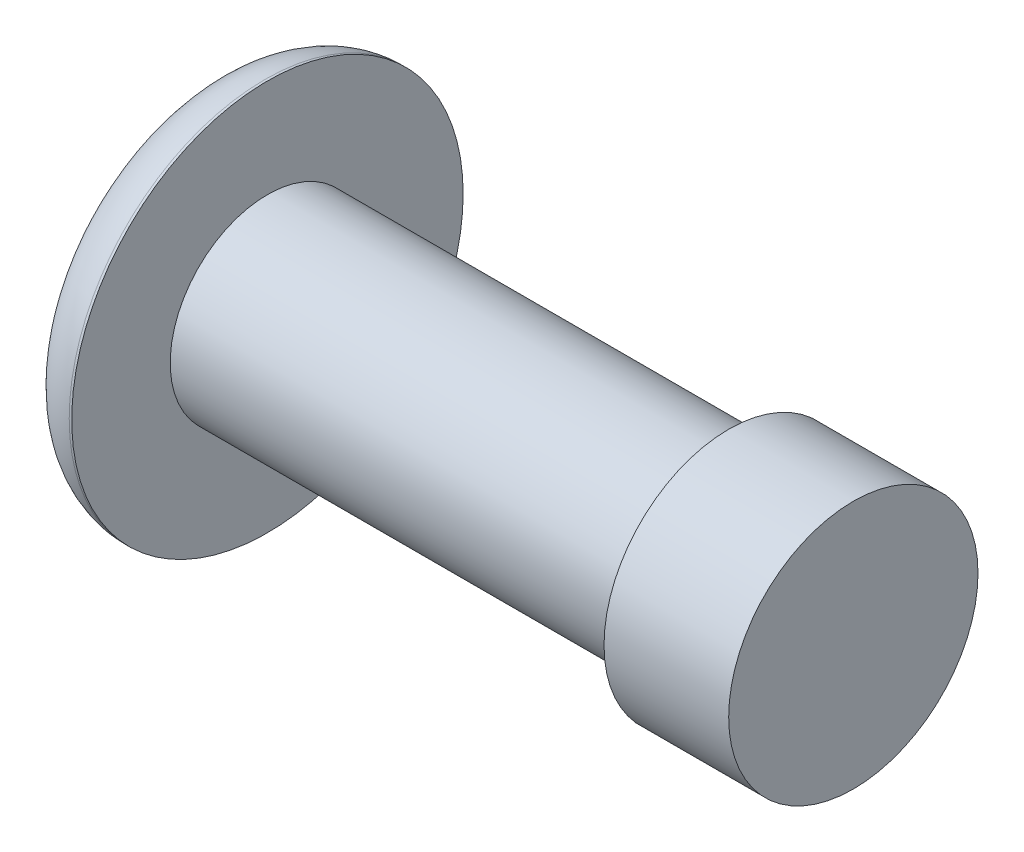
from build123d import *

# Parameters (mm, degrees)
FILLET1_R = 1.143


with BuildPart() as part:
    # Sketch1 → Revolve1 (revolve)
    with BuildSketch(Plane.XY, mode=Mode.PRIVATE) as revolve1_sk:
        Polygon((0, 0), (0, 2.54), (-2.54, 2.54), (-2.54, 1.9812), (-11.938, 1.9812), (-11.938, 3.9878), (-13.1318, 3.9878), (-13.1318, 0), align=None)
    revolve(revolve1_sk.sketch.rotate(Axis((0, 0, 0), (-1, 0, 0)), 90), axis=Axis((0, 0, 0), (-1, 0, 0)))

    # Fillet1
    fillet1_edges = [part.edges().sort_by_distance(p)[0] for p in [
        (-13.1318, 0, 3.9878),
    ]]
    fillet(fillet1_edges, radius=FILLET1_R)


solid = part.part
